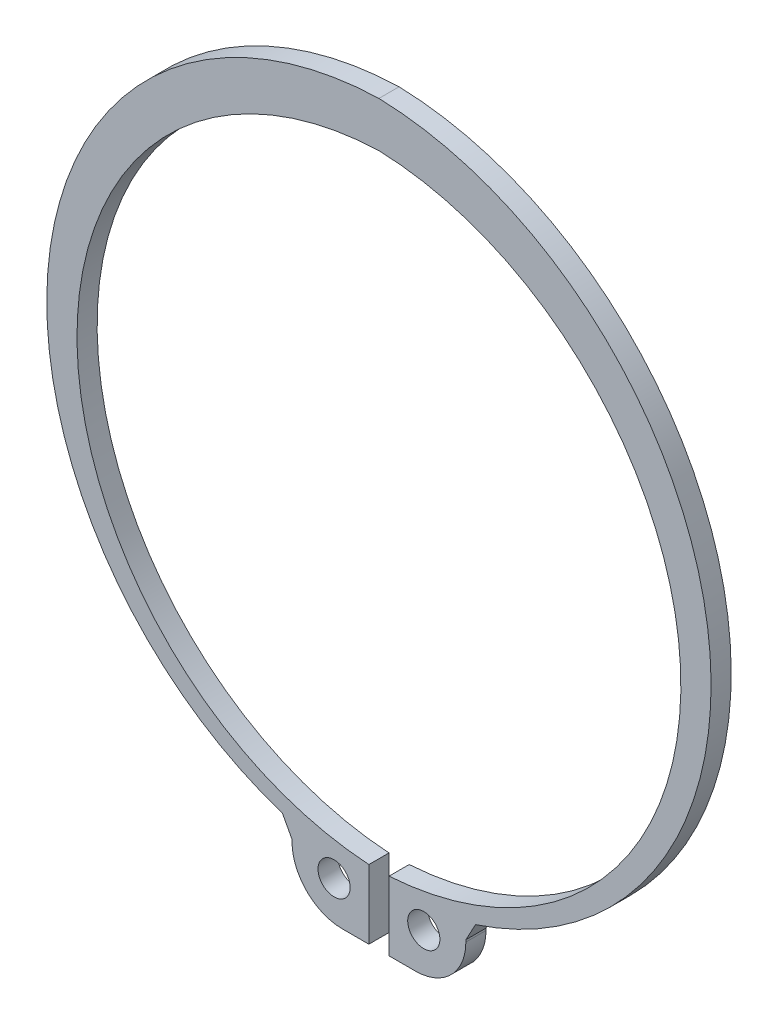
ISO-10303-21;
HEADER;
FILE_DESCRIPTION(('STEP AP214'),'2;1');
FILE_NAME('part.step','',(''),(''),'','','');
FILE_SCHEMA(('AUTOMOTIVE_DESIGN { 1 0 10303 214 1 1 1 1 }'));
ENDSEC;
DATA;
#1=APPLICATION_CONTEXT('core data for automotive mechanical design processes');
#2=APPLICATION_PROTOCOL_DEFINITION('international standard','automotive_design',2000,#1);
#3=PRODUCT_CONTEXT('',#1,'mechanical');
#4=PRODUCT('Part','Part','',(#3));
#5=PRODUCT_RELATED_PRODUCT_CATEGORY('part','',(#4));
#6=PRODUCT_DEFINITION_FORMATION('','',#4);
#7=PRODUCT_DEFINITION_CONTEXT('part definition',#1,'design');
#8=PRODUCT_DEFINITION('design','',#6,#7);
#9=PRODUCT_DEFINITION_SHAPE('','',#8);
#10=(LENGTH_UNIT() NAMED_UNIT(*) SI_UNIT(.MILLI.,.METRE.));
#11=(NAMED_UNIT(*) PLANE_ANGLE_UNIT() SI_UNIT($,.RADIAN.));
#12=(NAMED_UNIT(*) SI_UNIT($,.STERADIAN.) SOLID_ANGLE_UNIT());
#13=UNCERTAINTY_MEASURE_WITH_UNIT(LENGTH_MEASURE(1.E-05),#10,'distance_accuracy_value','');
#14=(GEOMETRIC_REPRESENTATION_CONTEXT(3) GLOBAL_UNCERTAINTY_ASSIGNED_CONTEXT((#13)) GLOBAL_UNIT_ASSIGNED_CONTEXT((#10,
#11,#12)) REPRESENTATION_CONTEXT('',''));
#15=CARTESIAN_POINT('',(0.,0.,0.));
#16=DIRECTION('',(0.,0.,1.));
#17=DIRECTION('',(1.,0.,0.));
#18=AXIS2_PLACEMENT_3D('',#15,#16,#17);
#19=CARTESIAN_POINT('',(-9.6363024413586,-40.204685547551,0.));
#20=DIRECTION('',(-1.,0.,0.));
#21=DIRECTION('',(0.,0.,-1.));
#22=AXIS2_PLACEMENT_3D('',#19,#20,#21);
#23=PLANE('',#22);
#24=DIRECTION('',(0.,-1.,0.));
#25=VECTOR('',#24,1.);
#26=CARTESIAN_POINT('',(-9.6363024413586,-41.204685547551,-2.));
#27=LINE('',#26,#25);
#28=CARTESIAN_POINT('',(-9.6363024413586,-40.2046855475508,-2.));
#29=VERTEX_POINT('',#28);
#30=CARTESIAN_POINT('',(-9.63630244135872,-40.407581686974,-2.));
#31=VERTEX_POINT('',#30);
#32=EDGE_CURVE('E177',#29,#31,#27,.T.);
#33=ORIENTED_EDGE('',*,*,#32,.T.);
#34=DIRECTION('',(0.,0.,1.));
#35=VECTOR('',#34,1.);
#36=CARTESIAN_POINT('',(-9.63630244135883,-40.4075816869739,-1.));
#37=LINE('',#36,#35);
#38=CARTESIAN_POINT('',(-9.63630244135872,-40.407581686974,0.));
#39=VERTEX_POINT('',#38);
#40=EDGE_CURVE('E161',#31,#39,#37,.T.);
#41=ORIENTED_EDGE('',*,*,#40,.T.);
#42=DIRECTION('',(0.,1.,0.));
#43=VECTOR('',#42,1.);
#44=CARTESIAN_POINT('',(-9.6363024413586,-41.204685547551,0.));
#45=LINE('',#44,#43);
#46=CARTESIAN_POINT('',(-9.6363024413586,-40.2046855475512,0.));
#47=VERTEX_POINT('',#46);
#48=EDGE_CURVE('E178',#39,#47,#45,.T.);
#49=ORIENTED_EDGE('',*,*,#48,.T.);
#50=DIRECTION('',(0.,0.,-1.));
#51=VECTOR('',#50,1.);
#52=CARTESIAN_POINT('',(-9.6363024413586,-40.204685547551,-1.00881310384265));
#53=LINE('',#52,#51);
#54=EDGE_CURVE('E122',#47,#29,#53,.T.);
#55=ORIENTED_EDGE('',*,*,#54,.T.);
#56=EDGE_LOOP('',(#33,#41,#49,#55));
#57=FACE_BOUND('',#56,.T.);
#58=ADVANCED_FACE('F16',(#57),#23,.T.);
#59=CARTESIAN_POINT('',(7.6363024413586,-40.407581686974,0.));
#60=DIRECTION('',(1.,0.,0.));
#61=DIRECTION('',(0.,0.,-1.));
#62=AXIS2_PLACEMENT_3D('',#59,#60,#61);
#63=PLANE('',#62);
#64=DIRECTION('',(0.,0.,1.));
#65=VECTOR('',#64,1.);
#66=CARTESIAN_POINT('',(7.6363024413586,-40.204685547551,-0.99118689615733));
#67=LINE('',#66,#65);
#68=CARTESIAN_POINT('',(7.6363024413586,-40.2046855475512,-2.));
#69=VERTEX_POINT('',#68);
#70=CARTESIAN_POINT('',(7.6363024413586,-40.2046855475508,0.));
#71=VERTEX_POINT('',#70);
#72=EDGE_CURVE('E154',#69,#71,#67,.T.);
#73=ORIENTED_EDGE('',*,*,#72,.T.);
#74=DIRECTION('',(0.,-1.,0.));
#75=VECTOR('',#74,1.);
#76=CARTESIAN_POINT('',(7.6363024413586,-39.407581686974,0.));
#77=LINE('',#76,#75);
#78=CARTESIAN_POINT('',(7.6363024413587,-40.407581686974,0.));
#79=VERTEX_POINT('',#78);
#80=EDGE_CURVE('E173',#71,#79,#77,.T.);
#81=ORIENTED_EDGE('',*,*,#80,.T.);
#82=DIRECTION('',(0.,0.,-1.));
#83=VECTOR('',#82,1.);
#84=CARTESIAN_POINT('',(7.63630244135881,-40.4075816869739,-1.));
#85=LINE('',#84,#83);
#86=CARTESIAN_POINT('',(7.6363024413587,-40.407581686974,-2.));
#87=VERTEX_POINT('',#86);
#88=EDGE_CURVE('E151',#79,#87,#85,.T.);
#89=ORIENTED_EDGE('',*,*,#88,.T.);
#90=DIRECTION('',(0.,1.,0.));
#91=VECTOR('',#90,1.);
#92=CARTESIAN_POINT('',(7.6363024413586,-39.407581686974,-2.));
#93=LINE('',#92,#91);
#94=EDGE_CURVE('E175',#87,#69,#93,.T.);
#95=ORIENTED_EDGE('',*,*,#94,.T.);
#96=EDGE_LOOP('',(#73,#81,#89,#95));
#97=FACE_BOUND('',#96,.T.);
#98=ADVANCED_FACE('F272',(#97),#63,.T.);
#99=CARTESIAN_POINT('',(0.,-7.6171875,0.));
#100=DIRECTION('',(0.,0.,-1.));
#101=DIRECTION('',(-1.,0.,0.));
#102=AXIS2_PLACEMENT_3D('',#99,#100,#101);
#103=CYLINDRICAL_SURFACE('',#102,31.0000000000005);
#104=CARTESIAN_POINT('',(0.,-7.6171875,-2.));
#105=DIRECTION('',(0.,0.,-1.));
#106=DIRECTION('',(-1.,0.,0.));
#107=AXIS2_PLACEMENT_3D('',#104,#105,#106);
#108=CIRCLE('',#107,31.0000000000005);
#109=CARTESIAN_POINT('',(-0.999999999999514,23.3666792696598,-2.));
#110=VERTEX_POINT('',#109);
#111=CARTESIAN_POINT('',(-1.99999999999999,-38.5526040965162,-2.));
#112=VERTEX_POINT('',#111);
#113=EDGE_CURVE('E207',#110,#112,#108,.F.);
#114=ORIENTED_EDGE('',*,*,#113,.F.);
#115=DIRECTION('',(0.,0.,-1.));
#116=VECTOR('',#115,1.);
#117=CARTESIAN_POINT('',(-0.999999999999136,23.3666792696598,-1.));
#118=LINE('',#117,#116);
#119=CARTESIAN_POINT('',(-0.999999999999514,23.3666792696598,0.));
#120=VERTEX_POINT('',#119);
#121=EDGE_CURVE('E136',#120,#110,#118,.T.);
#122=ORIENTED_EDGE('',*,*,#121,.F.);
#123=CARTESIAN_POINT('',(0.,-7.6171875,0.));
#124=DIRECTION('',(0.,0.,-1.));
#125=DIRECTION('',(-1.,0.,0.));
#126=AXIS2_PLACEMENT_3D('',#123,#124,#125);
#127=CIRCLE('',#126,31.0000000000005);
#128=CARTESIAN_POINT('',(-1.99999999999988,-38.5526040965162,0.));
#129=VERTEX_POINT('',#128);
#130=EDGE_CURVE('E225',#129,#120,#127,.T.);
#131=ORIENTED_EDGE('',*,*,#130,.F.);
#132=DIRECTION('',(0.,0.,1.));
#133=VECTOR('',#132,1.);
#134=CARTESIAN_POINT('',(-2.,-38.552604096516,-3.42748879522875));
#135=LINE('',#134,#133);
#136=EDGE_CURVE('E169',#112,#129,#135,.T.);
#137=ORIENTED_EDGE('',*,*,#136,.F.);
#138=EDGE_LOOP('',(#114,#122,#131,#137));
#139=FACE_BOUND('',#138,.T.);
#140=ADVANCED_FACE('F278',(#139),#103,.F.);
#141=CARTESIAN_POINT('',(-2.,-45.407581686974,0.));
#142=DIRECTION('',(1.,0.,0.));
#143=DIRECTION('',(0.,0.,-1.));
#144=AXIS2_PLACEMENT_3D('',#141,#142,#143);
#145=PLANE('',#144);
#146=DIRECTION('',(0.,-1.,0.));
#147=VECTOR('',#146,1.);
#148=CARTESIAN_POINT('',(-1.99999999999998,-8.7704512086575,-2.));
#149=LINE('',#148,#147);
#150=CARTESIAN_POINT('',(-1.99999999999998,-45.407581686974,-2.));
#151=VERTEX_POINT('',#150);
#152=EDGE_CURVE('E210',#112,#151,#149,.T.);
#153=ORIENTED_EDGE('',*,*,#152,.F.);
#154=ORIENTED_EDGE('',*,*,#136,.T.);
#155=DIRECTION('',(0.,1.,0.));
#156=VECTOR('',#155,1.);
#157=CARTESIAN_POINT('',(-1.99999999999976,-8.7704512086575,0.));
#158=LINE('',#157,#156);
#159=CARTESIAN_POINT('',(-1.99999999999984,-45.407581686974,0.));
#160=VERTEX_POINT('',#159);
#161=EDGE_CURVE('E228',#160,#129,#158,.T.);
#162=ORIENTED_EDGE('',*,*,#161,.F.);
#163=DIRECTION('',(0.,0.,1.));
#164=VECTOR('',#163,1.);
#165=CARTESIAN_POINT('',(-2.,-45.407581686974,-1.3181512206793));
#166=LINE('',#165,#164);
#167=EDGE_CURVE('E164',#151,#160,#166,.T.);
#168=ORIENTED_EDGE('',*,*,#167,.F.);
#169=EDGE_LOOP('',(#153,#154,#162,#168));
#170=FACE_BOUND('',#169,.T.);
#171=ADVANCED_FACE('F261',(#170),#145,.T.);
#172=CARTESIAN_POINT('',(-4.6363024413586,-45.407581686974,0.));
#173=DIRECTION('',(0.,-1.,0.));
#174=DIRECTION('',(0.,0.,-1.));
#175=AXIS2_PLACEMENT_3D('',#172,#173,#174);
#176=PLANE('',#175);
#177=DIRECTION('',(-1.,0.,0.));
#178=VECTOR('',#177,1.);
#179=CARTESIAN_POINT('',(-0.999999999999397,-45.407581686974,-2.));
#180=LINE('',#179,#178);
#181=CARTESIAN_POINT('',(-4.63630244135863,-45.4075816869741,-2.));
#182=VERTEX_POINT('',#181);
#183=EDGE_CURVE('E206',#151,#182,#180,.T.);
#184=ORIENTED_EDGE('',*,*,#183,.F.);
#185=ORIENTED_EDGE('',*,*,#167,.T.);
#186=DIRECTION('',(1.,0.,0.));
#187=VECTOR('',#186,1.);
#188=CARTESIAN_POINT('',(-1.0000000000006,-45.407581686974,0.));
#189=LINE('',#188,#187);
#190=CARTESIAN_POINT('',(-4.63630244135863,-45.4075816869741,0.));
#191=VERTEX_POINT('',#190);
#192=EDGE_CURVE('E230',#191,#160,#189,.T.);
#193=ORIENTED_EDGE('',*,*,#192,.F.);
#194=DIRECTION('',(0.,0.,-1.));
#195=VECTOR('',#194,1.);
#196=CARTESIAN_POINT('',(-4.63630244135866,-45.4075816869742,-1.));
#197=LINE('',#196,#195);
#198=EDGE_CURVE('E162',#191,#182,#197,.T.);
#199=ORIENTED_EDGE('',*,*,#198,.T.);
#200=EDGE_LOOP('',(#184,#185,#193,#199));
#201=FACE_BOUND('',#200,.T.);
#202=ADVANCED_FACE('F265',(#201),#176,.T.);
#203=CARTESIAN_POINT('',(-4.6363024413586,-40.407581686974,-2.));
#204=DIRECTION('',(0.,0.,1.));
#205=DIRECTION('',(1.,0.,0.));
#206=AXIS2_PLACEMENT_3D('',#203,#204,#205);
#207=CYLINDRICAL_SURFACE('',#206,5.00000000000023);
#208=ORIENTED_EDGE('',*,*,#40,.F.);
#209=CARTESIAN_POINT('',(-4.6363024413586,-40.407581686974,-2.));
#210=DIRECTION('',(0.,0.,1.));
#211=DIRECTION('',(1.,0.,0.));
#212=AXIS2_PLACEMENT_3D('',#209,#210,#211);
#213=CIRCLE('',#212,5.00000000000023);
#214=EDGE_CURVE('E203',#182,#31,#213,.F.);
#215=ORIENTED_EDGE('',*,*,#214,.F.);
#216=ORIENTED_EDGE('',*,*,#198,.F.);
#217=CARTESIAN_POINT('',(-4.6363024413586,-40.407581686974,0.));
#218=DIRECTION('',(0.,0.,1.));
#219=DIRECTION('',(1.,0.,0.));
#220=AXIS2_PLACEMENT_3D('',#217,#218,#219);
#221=CIRCLE('',#220,5.00000000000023);
#222=EDGE_CURVE('E130',#39,#191,#221,.T.);
#223=ORIENTED_EDGE('',*,*,#222,.F.);
#224=EDGE_LOOP('',(#208,#215,#216,#223));
#225=FACE_BOUND('',#224,.T.);
#226=ADVANCED_FACE('F269',(#225),#207,.T.);
#227=CARTESIAN_POINT('',(-10.59071835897,-38.427073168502,0.));
#228=DIRECTION('',(0.881041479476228,0.473039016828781,0.));
#229=DIRECTION('',(0.473039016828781,-0.881041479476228,0.));
#230=AXIS2_PLACEMENT_3D('',#227,#228,#229);
#231=PLANE('',#230);
#232=DIRECTION('',(-0.473039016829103,0.881041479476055,0.));
#233=VECTOR('',#232,1.);
#234=CARTESIAN_POINT('',(-9.63630244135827,-40.2046855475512,-2.));
#235=LINE('',#234,#233);
#236=CARTESIAN_POINT('',(-10.5907183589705,-38.427073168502,-2.));
#237=VERTEX_POINT('',#236);
#238=EDGE_CURVE('E201',#29,#237,#235,.T.);
#239=ORIENTED_EDGE('',*,*,#238,.F.);
#240=ORIENTED_EDGE('',*,*,#54,.F.);
#241=DIRECTION('',(0.473039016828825,-0.881041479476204,0.));
#242=VECTOR('',#241,1.);
#243=CARTESIAN_POINT('',(-10.5907183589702,-38.4270731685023,0.));
#244=LINE('',#243,#242);
#245=CARTESIAN_POINT('',(-10.5907183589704,-38.4270731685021,0.));
#246=VERTEX_POINT('',#245);
#247=EDGE_CURVE('E126',#246,#47,#244,.T.);
#248=ORIENTED_EDGE('',*,*,#247,.F.);
#249=DIRECTION('',(0.,0.,-1.));
#250=VECTOR('',#249,1.);
#251=CARTESIAN_POINT('',(-10.5907183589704,-38.4270731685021,-1.));
#252=LINE('',#251,#250);
#253=EDGE_CURVE('E113',#246,#237,#252,.T.);
#254=ORIENTED_EDGE('',*,*,#253,.T.);
#255=EDGE_LOOP('',(#239,#240,#248,#254));
#256=FACE_BOUND('',#255,.T.);
#257=ADVANCED_FACE('F127',(#256),#231,.F.);
#258=CARTESIAN_POINT('',(0.,-6.1186116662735,-2.));
#259=DIRECTION('',(0.,0.,1.));
#260=DIRECTION('',(1.,0.,0.));
#261=AXIS2_PLACEMENT_3D('',#258,#259,#260);
#262=CYLINDRICAL_SURFACE('',#261,34.0000000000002);
#263=DIRECTION('',(0.,0.,-1.));
#264=VECTOR('',#263,1.);
#265=CARTESIAN_POINT('',(-0.999999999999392,27.8666792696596,-1.));
#266=LINE('',#265,#264);
#267=CARTESIAN_POINT('',(-0.999999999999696,27.8666792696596,0.));
#268=VERTEX_POINT('',#267);
#269=CARTESIAN_POINT('',(-0.999999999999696,27.8666792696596,-2.));
#270=VERTEX_POINT('',#269);
#271=EDGE_CURVE('E121',#268,#270,#266,.T.);
#272=ORIENTED_EDGE('',*,*,#271,.T.);
#273=CARTESIAN_POINT('',(0.,-6.1186116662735,-2.));
#274=DIRECTION('',(0.,0.,1.));
#275=DIRECTION('',(1.,0.,0.));
#276=AXIS2_PLACEMENT_3D('',#273,#274,#275);
#277=CIRCLE('',#276,34.0000000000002);
#278=EDGE_CURVE('E117',#237,#270,#277,.F.);
#279=ORIENTED_EDGE('',*,*,#278,.F.);
#280=ORIENTED_EDGE('',*,*,#253,.F.);
#281=CARTESIAN_POINT('',(0.,-6.1186116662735,0.));
#282=DIRECTION('',(0.,0.,1.));
#283=DIRECTION('',(1.,0.,0.));
#284=AXIS2_PLACEMENT_3D('',#281,#282,#283);
#285=CIRCLE('',#284,34.0000000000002);
#286=EDGE_CURVE('E20',#268,#246,#285,.T.);
#287=ORIENTED_EDGE('',*,*,#286,.F.);
#288=EDGE_LOOP('',(#272,#279,#280,#287));
#289=FACE_BOUND('',#288,.T.);
#290=ADVANCED_FACE('F115',(#289),#262,.T.);
#291=CARTESIAN_POINT('',(-2.,-6.1186116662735,0.));
#292=DIRECTION('',(0.,0.,-1.));
#293=DIRECTION('',(-1.,0.,0.));
#294=AXIS2_PLACEMENT_3D('',#291,#292,#293);
#295=CYLINDRICAL_SURFACE('',#294,34.0000000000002);
#296=CARTESIAN_POINT('',(-2.,-6.1186116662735,-2.));
#297=DIRECTION('',(0.,0.,-1.));
#298=DIRECTION('',(-1.,0.,0.));
#299=AXIS2_PLACEMENT_3D('',#296,#297,#298);
#300=CIRCLE('',#299,34.0000000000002);
#301=CARTESIAN_POINT('',(8.59071835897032,-38.427073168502,-2.));
#302=VERTEX_POINT('',#301);
#303=EDGE_CURVE('E197',#270,#302,#300,.T.);
#304=ORIENTED_EDGE('',*,*,#303,.F.);
#305=ORIENTED_EDGE('',*,*,#271,.F.);
#306=CARTESIAN_POINT('',(-2.,-6.1186116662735,0.));
#307=DIRECTION('',(0.,0.,-1.));
#308=DIRECTION('',(-1.,0.,0.));
#309=AXIS2_PLACEMENT_3D('',#306,#307,#308);
#310=CIRCLE('',#309,34.0000000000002);
#311=CARTESIAN_POINT('',(8.59071835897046,-38.427073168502,0.));
#312=VERTEX_POINT('',#311);
#313=EDGE_CURVE('E135',#312,#268,#310,.F.);
#314=ORIENTED_EDGE('',*,*,#313,.F.);
#315=DIRECTION('',(0.,0.,-1.));
#316=VECTOR('',#315,1.);
#317=CARTESIAN_POINT('',(8.5907183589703,-38.427073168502,-0.99118689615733));
#318=LINE('',#317,#316);
#319=EDGE_CURVE('E155',#312,#302,#318,.T.);
#320=ORIENTED_EDGE('',*,*,#319,.T.);
#321=EDGE_LOOP('',(#304,#305,#314,#320));
#322=FACE_BOUND('',#321,.T.);
#323=ADVANCED_FACE('F305',(#322),#295,.T.);
#324=CARTESIAN_POINT('',(8.5907183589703,-38.427073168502,-2.));
#325=DIRECTION('',(-0.881041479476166,0.473039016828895,0.));
#326=DIRECTION('',(-0.473039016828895,-0.881041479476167,0.));
#327=AXIS2_PLACEMENT_3D('',#324,#325,#326);
#328=PLANE('',#327);
#329=ORIENTED_EDGE('',*,*,#72,.F.);
#330=DIRECTION('',(-0.473039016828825,-0.881041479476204,0.));
#331=VECTOR('',#330,1.);
#332=CARTESIAN_POINT('',(8.59071835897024,-38.4270731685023,-2.));
#333=LINE('',#332,#331);
#334=EDGE_CURVE('E194',#302,#69,#333,.T.);
#335=ORIENTED_EDGE('',*,*,#334,.F.);
#336=ORIENTED_EDGE('',*,*,#319,.F.);
#337=DIRECTION('',(0.473039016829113,0.881041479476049,0.));
#338=VECTOR('',#337,1.);
#339=CARTESIAN_POINT('',(7.63630244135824,-40.2046855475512,0.));
#340=LINE('',#339,#338);
#341=EDGE_CURVE('E215',#71,#312,#340,.T.);
#342=ORIENTED_EDGE('',*,*,#341,.F.);
#343=EDGE_LOOP('',(#329,#335,#336,#342));
#344=FACE_BOUND('',#343,.T.);
#345=ADVANCED_FACE('F303',(#344),#328,.F.);
#346=CARTESIAN_POINT('',(2.6363024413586,-40.407581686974,0.));
#347=DIRECTION('',(0.,0.,-1.));
#348=DIRECTION('',(-1.,0.,0.));
#349=AXIS2_PLACEMENT_3D('',#346,#347,#348);
#350=CYLINDRICAL_SURFACE('',#349,5.00000000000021);
#351=CARTESIAN_POINT('',(2.6363024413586,-40.407581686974,-2.));
#352=DIRECTION('',(0.,0.,-1.));
#353=DIRECTION('',(-1.,0.,0.));
#354=AXIS2_PLACEMENT_3D('',#351,#352,#353);
#355=CIRCLE('',#354,5.00000000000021);
#356=CARTESIAN_POINT('',(2.6363024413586,-45.407581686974,-2.));
#357=VERTEX_POINT('',#356);
#358=EDGE_CURVE('E190',#87,#357,#355,.T.);
#359=ORIENTED_EDGE('',*,*,#358,.F.);
#360=ORIENTED_EDGE('',*,*,#88,.F.);
#361=CARTESIAN_POINT('',(2.6363024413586,-40.407581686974,0.));
#362=DIRECTION('',(0.,0.,-1.));
#363=DIRECTION('',(-1.,0.,0.));
#364=AXIS2_PLACEMENT_3D('',#361,#362,#363);
#365=CIRCLE('',#364,5.00000000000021);
#366=CARTESIAN_POINT('',(2.6363024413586,-45.407581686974,0.));
#367=VERTEX_POINT('',#366);
#368=EDGE_CURVE('E217',#367,#79,#365,.F.);
#369=ORIENTED_EDGE('',*,*,#368,.F.);
#370=DIRECTION('',(0.,0.,1.));
#371=VECTOR('',#370,1.);
#372=CARTESIAN_POINT('',(2.6363024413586,-45.407581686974,-1.3181512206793));
#373=LINE('',#372,#371);
#374=EDGE_CURVE('E147',#357,#367,#373,.T.);
#375=ORIENTED_EDGE('',*,*,#374,.F.);
#376=EDGE_LOOP('',(#359,#360,#369,#375));
#377=FACE_BOUND('',#376,.T.);
#378=ADVANCED_FACE('F299',(#377),#350,.T.);
#379=CARTESIAN_POINT('',(0.,-45.407581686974,0.));
#380=DIRECTION('',(0.,-1.,0.));
#381=DIRECTION('',(0.,0.,-1.));
#382=AXIS2_PLACEMENT_3D('',#379,#380,#381);
#383=PLANE('',#382);
#384=ORIENTED_EDGE('',*,*,#374,.T.);
#385=DIRECTION('',(1.,0.,0.));
#386=VECTOR('',#385,1.);
#387=CARTESIAN_POINT('',(-1.0000000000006,-45.407581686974,0.));
#388=LINE('',#387,#386);
#389=CARTESIAN_POINT('',(0.,-45.407581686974,0.));
#390=VERTEX_POINT('',#389);
#391=EDGE_CURVE('E220',#390,#367,#388,.T.);
#392=ORIENTED_EDGE('',*,*,#391,.F.);
#393=DIRECTION('',(0.,0.,1.));
#394=VECTOR('',#393,1.);
#395=CARTESIAN_POINT('',(0.,-45.407581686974,-3.42748879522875));
#396=LINE('',#395,#394);
#397=CARTESIAN_POINT('',(-1.59594559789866E-13,-45.407581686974,-2.));
#398=VERTEX_POINT('',#397);
#399=EDGE_CURVE('E141',#398,#390,#396,.T.);
#400=ORIENTED_EDGE('',*,*,#399,.F.);
#401=DIRECTION('',(-1.,0.,0.));
#402=VECTOR('',#401,1.);
#403=CARTESIAN_POINT('',(-0.999999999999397,-45.407581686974,-2.));
#404=LINE('',#403,#402);
#405=EDGE_CURVE('E193',#357,#398,#404,.T.);
#406=ORIENTED_EDGE('',*,*,#405,.F.);
#407=EDGE_LOOP('',(#384,#392,#400,#406));
#408=FACE_BOUND('',#407,.T.);
#409=ADVANCED_FACE('F302',(#408),#383,.T.);
#410=CARTESIAN_POINT('',(0.,-38.552604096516,0.));
#411=DIRECTION('',(-1.,0.,0.));
#412=DIRECTION('',(0.,0.,-1.));
#413=AXIS2_PLACEMENT_3D('',#410,#411,#412);
#414=PLANE('',#413);
#415=ORIENTED_EDGE('',*,*,#399,.T.);
#416=DIRECTION('',(0.,-1.,0.));
#417=VECTOR('',#416,1.);
#418=CARTESIAN_POINT('',(0.,-8.7704512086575,0.));
#419=LINE('',#418,#417);
#420=CARTESIAN_POINT('',(6.59194920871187E-13,-38.5526040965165,0.));
#421=VERTEX_POINT('',#420);
#422=EDGE_CURVE('E224',#421,#390,#419,.T.);
#423=ORIENTED_EDGE('',*,*,#422,.F.);
#424=DIRECTION('',(0.,0.,1.));
#425=VECTOR('',#424,1.);
#426=CARTESIAN_POINT('',(1.34267597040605E-12,-38.5526040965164,-1.));
#427=LINE('',#426,#425);
#428=CARTESIAN_POINT('',(5.51642065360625E-13,-38.5526040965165,-2.));
#429=VERTEX_POINT('',#428);
#430=EDGE_CURVE('E35',#429,#421,#427,.T.);
#431=ORIENTED_EDGE('',*,*,#430,.F.);
#432=DIRECTION('',(0.,1.,0.));
#433=VECTOR('',#432,1.);
#434=CARTESIAN_POINT('',(-2.39391839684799E-13,-8.7704512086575,-2.));
#435=LINE('',#434,#433);
#436=EDGE_CURVE('E189',#398,#429,#435,.T.);
#437=ORIENTED_EDGE('',*,*,#436,.F.);
#438=EDGE_LOOP('',(#415,#423,#431,#437));
#439=FACE_BOUND('',#438,.T.);
#440=ADVANCED_FACE('F298',(#439),#414,.T.);
#441=CARTESIAN_POINT('',(-2.,-7.6171875,-2.));
#442=DIRECTION('',(0.,0.,1.));
#443=DIRECTION('',(1.,0.,0.));
#444=AXIS2_PLACEMENT_3D('',#441,#442,#443);
#445=CYLINDRICAL_SURFACE('',#444,31.0000000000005);
#446=ORIENTED_EDGE('',*,*,#430,.T.);
#447=CARTESIAN_POINT('',(-2.,-7.6171875,0.));
#448=DIRECTION('',(0.,0.,1.));
#449=DIRECTION('',(1.,0.,0.));
#450=AXIS2_PLACEMENT_3D('',#447,#448,#449);
#451=CIRCLE('',#450,31.0000000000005);
#452=EDGE_CURVE('E221',#120,#421,#451,.F.);
#453=ORIENTED_EDGE('',*,*,#452,.F.);
#454=ORIENTED_EDGE('',*,*,#121,.T.);
#455=CARTESIAN_POINT('',(-2.,-7.6171875,-2.));
#456=DIRECTION('',(0.,0.,1.));
#457=DIRECTION('',(1.,0.,0.));
#458=AXIS2_PLACEMENT_3D('',#455,#456,#457);
#459=CIRCLE('',#458,31.0000000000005);
#460=EDGE_CURVE('E186',#429,#110,#459,.T.);
#461=ORIENTED_EDGE('',*,*,#460,.F.);
#462=EDGE_LOOP('',(#446,#453,#454,#461));
#463=FACE_BOUND('',#462,.T.);
#464=ADVANCED_FACE('F294',(#463),#445,.F.);
#465=CARTESIAN_POINT('',(3.4564777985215,-41.465633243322,-2.));
#466=DIRECTION('',(0.,0.,1.));
#467=DIRECTION('',(1.,0.,0.));
#468=AXIS2_PLACEMENT_3D('',#465,#466,#467);
#469=CYLINDRICAL_SURFACE('',#468,1.597168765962);
#470=CARTESIAN_POINT('',(3.4564777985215,-41.465633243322,-2.));
#471=DIRECTION('',(0.,0.,1.));
#472=DIRECTION('',(1.,0.,0.));
#473=AXIS2_PLACEMENT_3D('',#470,#471,#472);
#474=CIRCLE('',#473,1.597168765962);
#475=CARTESIAN_POINT('',(5.0536465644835,-41.465633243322,-2.));
#476=VERTEX_POINT('',#475);
#477=EDGE_CURVE('E183',#476,#476,#474,.T.);
#478=ORIENTED_EDGE('',*,*,#477,.F.);
#479=EDGE_LOOP('',(#478));
#480=FACE_BOUND('',#479,.T.);
#481=CARTESIAN_POINT('',(3.4564777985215,-41.465633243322,0.));
#482=DIRECTION('',(0.,0.,1.));
#483=DIRECTION('',(1.,0.,0.));
#484=AXIS2_PLACEMENT_3D('',#481,#482,#483);
#485=CIRCLE('',#484,1.597168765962);
#486=CARTESIAN_POINT('',(5.0536465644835,-41.465633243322,0.));
#487=VERTEX_POINT('',#486);
#488=EDGE_CURVE('E211',#487,#487,#485,.F.);
#489=ORIENTED_EDGE('',*,*,#488,.F.);
#490=EDGE_LOOP('',(#489));
#491=FACE_BOUND('',#490,.T.);
#492=ADVANCED_FACE('F291',(#480,#491),#469,.F.);
#493=CARTESIAN_POINT('',(-195.38074449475,-45.407581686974,0.));
#494=DIRECTION('',(0.,0.,1.));
#495=DIRECTION('',(1.,0.,0.));
#496=AXIS2_PLACEMENT_3D('',#493,#494,#495);
#497=PLANE('',#496);
#498=ORIENTED_EDGE('',*,*,#488,.T.);
#499=EDGE_LOOP('',(#498));
#500=FACE_BOUND('',#499,.T.);
#501=CARTESIAN_POINT('',(-5.4564777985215,-41.465633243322,0.));
#502=DIRECTION('',(0.,0.,-1.));
#503=DIRECTION('',(-1.,0.,0.));
#504=AXIS2_PLACEMENT_3D('',#501,#502,#503);
#505=CIRCLE('',#504,1.597168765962);
#506=CARTESIAN_POINT('',(-7.0536465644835,-41.465633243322,0.));
#507=VERTEX_POINT('',#506);
#508=EDGE_CURVE('E26',#507,#507,#505,.F.);
#509=ORIENTED_EDGE('',*,*,#508,.F.);
#510=EDGE_LOOP('',(#509));
#511=FACE_BOUND('',#510,.T.);
#512=ORIENTED_EDGE('',*,*,#341,.T.);
#513=ORIENTED_EDGE('',*,*,#313,.T.);
#514=ORIENTED_EDGE('',*,*,#286,.T.);
#515=ORIENTED_EDGE('',*,*,#247,.T.);
#516=ORIENTED_EDGE('',*,*,#48,.F.);
#517=ORIENTED_EDGE('',*,*,#222,.T.);
#518=ORIENTED_EDGE('',*,*,#192,.T.);
#519=ORIENTED_EDGE('',*,*,#161,.T.);
#520=ORIENTED_EDGE('',*,*,#130,.T.);
#521=ORIENTED_EDGE('',*,*,#452,.T.);
#522=ORIENTED_EDGE('',*,*,#422,.T.);
#523=ORIENTED_EDGE('',*,*,#391,.T.);
#524=ORIENTED_EDGE('',*,*,#368,.T.);
#525=ORIENTED_EDGE('',*,*,#80,.F.);
#526=EDGE_LOOP('',(#512,#513,#514,#515,#516,#517,#518,#519,#520,#521,#522,#523,#524,#525));
#527=FACE_BOUND('',#526,.T.);
#528=ADVANCED_FACE('F133',(#500,#511,#527),#497,.T.);
#529=CARTESIAN_POINT('',(193.38074449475,-45.407581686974,-2.));
#530=DIRECTION('',(0.,0.,-1.));
#531=DIRECTION('',(-1.,0.,0.));
#532=AXIS2_PLACEMENT_3D('',#529,#530,#531);
#533=PLANE('',#532);
#534=ORIENTED_EDGE('',*,*,#477,.T.);
#535=EDGE_LOOP('',(#534));
#536=FACE_BOUND('',#535,.T.);
#537=CARTESIAN_POINT('',(-5.4564777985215,-41.465633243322,-2.));
#538=DIRECTION('',(0.,0.,-1.));
#539=DIRECTION('',(-1.,0.,0.));
#540=AXIS2_PLACEMENT_3D('',#537,#538,#539);
#541=CIRCLE('',#540,1.597168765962);
#542=CARTESIAN_POINT('',(-7.0536465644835,-41.465633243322,-2.));
#543=VERTEX_POINT('',#542);
#544=EDGE_CURVE('E10',#543,#543,#541,.T.);
#545=ORIENTED_EDGE('',*,*,#544,.F.);
#546=EDGE_LOOP('',(#545));
#547=FACE_BOUND('',#546,.T.);
#548=ORIENTED_EDGE('',*,*,#436,.T.);
#549=ORIENTED_EDGE('',*,*,#460,.T.);
#550=ORIENTED_EDGE('',*,*,#113,.T.);
#551=ORIENTED_EDGE('',*,*,#152,.T.);
#552=ORIENTED_EDGE('',*,*,#183,.T.);
#553=ORIENTED_EDGE('',*,*,#214,.T.);
#554=ORIENTED_EDGE('',*,*,#32,.F.);
#555=ORIENTED_EDGE('',*,*,#238,.T.);
#556=ORIENTED_EDGE('',*,*,#278,.T.);
#557=ORIENTED_EDGE('',*,*,#303,.T.);
#558=ORIENTED_EDGE('',*,*,#334,.T.);
#559=ORIENTED_EDGE('',*,*,#94,.F.);
#560=ORIENTED_EDGE('',*,*,#358,.T.);
#561=ORIENTED_EDGE('',*,*,#405,.T.);
#562=EDGE_LOOP('',(#548,#549,#550,#551,#552,#553,#554,#555,#556,#557,#558,#559,#560,#561));
#563=FACE_BOUND('',#562,.T.);
#564=ADVANCED_FACE('F18',(#536,#547,#563),#533,.T.);
#565=CARTESIAN_POINT('',(-5.4564777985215,-41.465633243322,0.));
#566=DIRECTION('',(0.,0.,-1.));
#567=DIRECTION('',(-1.,0.,0.));
#568=AXIS2_PLACEMENT_3D('',#565,#566,#567);
#569=CYLINDRICAL_SURFACE('',#568,1.597168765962);
#570=ORIENTED_EDGE('',*,*,#544,.T.);
#571=EDGE_LOOP('',(#570));
#572=FACE_BOUND('',#571,.T.);
#573=ORIENTED_EDGE('',*,*,#508,.T.);
#574=EDGE_LOOP('',(#573));
#575=FACE_BOUND('',#574,.T.);
#576=ADVANCED_FACE('F282',(#572,#575),#569,.F.);
#577=CLOSED_SHELL('',(#58,#98,#140,#171,#202,#226,#257,#290,#323,#345,#378,#409,#440,#464,#492,
#528,#564,#576));
#578=MANIFOLD_SOLID_BREP('B1',#577);
#579=ADVANCED_BREP_SHAPE_REPRESENTATION('',(#18,#578),#14);
#580=SHAPE_DEFINITION_REPRESENTATION(#9,#579);
ENDSEC;
END-ISO-10303-21;
